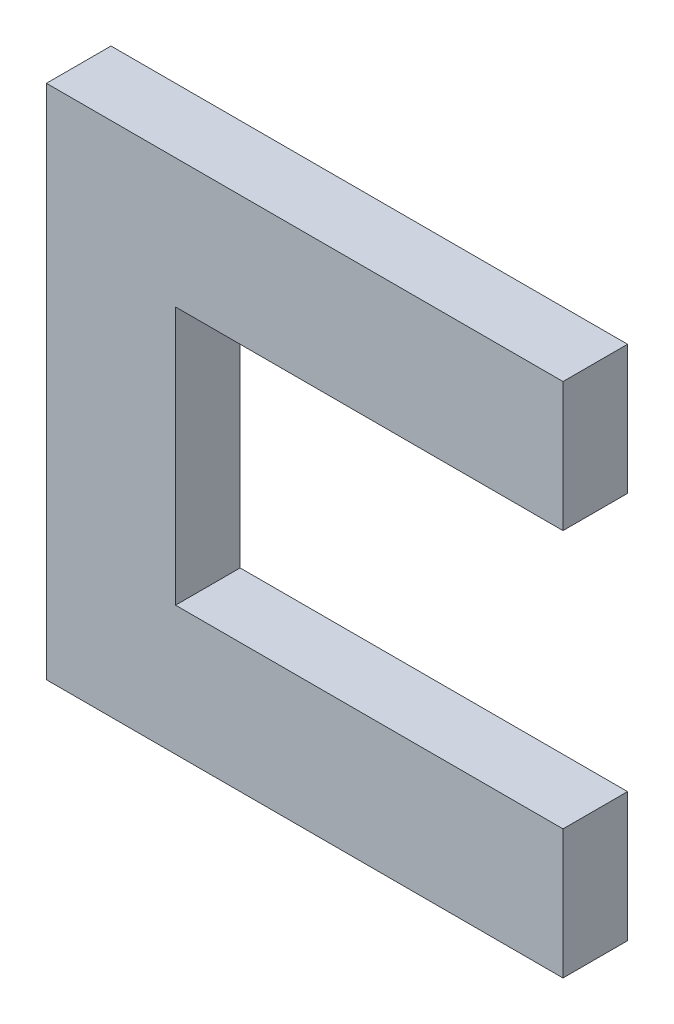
from build123d import *

# Parameters (mm, degrees)
EXTRUDE1_DEPTH = 10


with BuildPart() as part:
    # Sketch1 → Extrude1 (new body)
    with BuildSketch(Plane.XY):
        Polygon((14.521696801, 7.733936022), (14.521696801, 27.733936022), (-65.478303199, 27.733936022), (-65.478303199, -52.266063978), (14.521696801, -52.266063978), (14.521696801, -32.266063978), (-45.478303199, -32.266063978), (-45.478303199, 7.733936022), align=None)
    extrude(amount=EXTRUDE1_DEPTH)


solid = part.part
